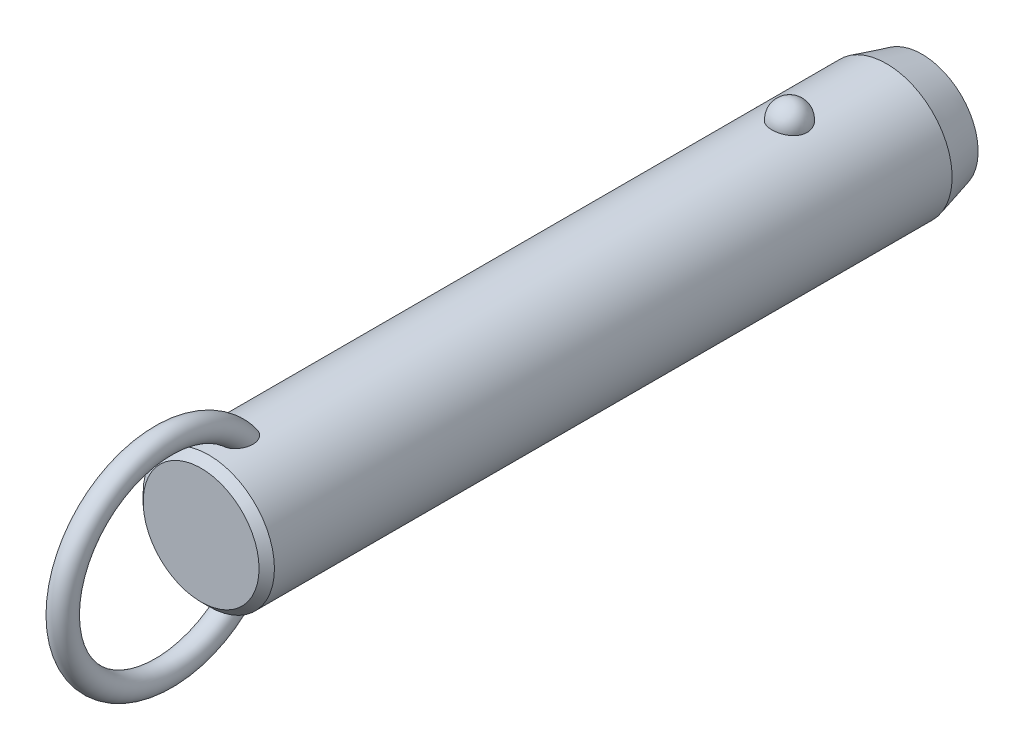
ISO-10303-21;
HEADER;
FILE_DESCRIPTION(('STEP AP214'),'2;1');
FILE_NAME('part.step','',(''),(''),'','','');
FILE_SCHEMA(('AUTOMOTIVE_DESIGN { 1 0 10303 214 1 1 1 1 }'));
ENDSEC;
DATA;
#1=APPLICATION_CONTEXT('core data for automotive mechanical design processes');
#2=APPLICATION_PROTOCOL_DEFINITION('international standard','automotive_design',2000,#1);
#3=PRODUCT_CONTEXT('',#1,'mechanical');
#4=PRODUCT('Part','Part','',(#3));
#5=PRODUCT_RELATED_PRODUCT_CATEGORY('part','',(#4));
#6=PRODUCT_DEFINITION_FORMATION('','',#4);
#7=PRODUCT_DEFINITION_CONTEXT('part definition',#1,'design');
#8=PRODUCT_DEFINITION('design','',#6,#7);
#9=PRODUCT_DEFINITION_SHAPE('','',#8);
#10=(LENGTH_UNIT() NAMED_UNIT(*) SI_UNIT(.MILLI.,.METRE.));
#11=(NAMED_UNIT(*) PLANE_ANGLE_UNIT() SI_UNIT($,.RADIAN.));
#12=(NAMED_UNIT(*) SI_UNIT($,.STERADIAN.) SOLID_ANGLE_UNIT());
#13=UNCERTAINTY_MEASURE_WITH_UNIT(LENGTH_MEASURE(1.E-05),#10,'distance_accuracy_value','');
#14=(GEOMETRIC_REPRESENTATION_CONTEXT(3) GLOBAL_UNCERTAINTY_ASSIGNED_CONTEXT((#13)) GLOBAL_UNIT_ASSIGNED_CONTEXT((#10,
#11,#12)) REPRESENTATION_CONTEXT('',''));
#15=CARTESIAN_POINT('',(0.,0.,0.));
#16=DIRECTION('',(0.,0.,1.));
#17=DIRECTION('',(1.,0.,0.));
#18=AXIS2_PLACEMENT_3D('',#15,#16,#17);
#19=CARTESIAN_POINT('',(0.,0.,83.8));
#20=DIRECTION('',(0.,0.,-1.));
#21=DIRECTION('',(-1.,0.,0.));
#22=AXIS2_PLACEMENT_3D('',#19,#20,#21);
#23=CYLINDRICAL_SURFACE('',#22,11.1);
#24=CARTESIAN_POINT('',(2.9724815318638,10.6945945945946,-3.));
#25=CARTESIAN_POINT('',(2.97247830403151,10.6945972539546,-2.83225059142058));
#26=CARTESIAN_POINT('',(2.95876598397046,10.6984356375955,-2.66445972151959));
#27=CARTESIAN_POINT('',(2.90424529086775,10.7133624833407,-2.33362381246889));
#28=CARTESIAN_POINT('',(2.8634252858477,10.7244540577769,-2.1705808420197));
#29=CARTESIAN_POINT('',(2.75573657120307,10.7526272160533,-1.85396767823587));
#30=CARTESIAN_POINT('',(2.68887937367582,10.7697061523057,-1.70039333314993));
#31=CARTESIAN_POINT('',(2.53079696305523,10.8079438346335,-1.40691598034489));
#32=CARTESIAN_POINT('',(2.43957264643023,10.8291024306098,-1.2670124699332));
#33=CARTESIAN_POINT('',(2.23458150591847,10.8732541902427,-1.00409565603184));
#34=CARTESIAN_POINT('',(2.12071295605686,10.8962553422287,-0.881162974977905));
#35=CARTESIAN_POINT('',(1.87365402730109,10.9414421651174,-0.656352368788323));
#36=CARTESIAN_POINT('',(1.74046358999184,10.9636278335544,-0.554474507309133));
#37=CARTESIAN_POINT('',(1.45872188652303,11.0046495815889,-0.374872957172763));
#38=CARTESIAN_POINT('',(1.31021276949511,11.0234944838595,-0.297085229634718));
#39=CARTESIAN_POINT('',(1.00170030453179,11.0557957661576,-0.167529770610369));
#40=CARTESIAN_POINT('',(0.841698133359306,11.0692526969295,-0.115759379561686));
#41=CARTESIAN_POINT('',(0.517607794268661,11.0890932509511,-0.0403925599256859));
#42=CARTESIAN_POINT('',(0.353633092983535,11.0955916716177,-0.0163383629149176));
#43=CARTESIAN_POINT('',(0.0238420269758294,11.1011989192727,0.0044517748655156));
#44=CARTESIAN_POINT('',(-0.141974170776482,11.1003084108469,0.00119017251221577));
#45=CARTESIAN_POINT('',(-0.468405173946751,11.0912990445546,-0.0323233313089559));
#46=CARTESIAN_POINT('',(-0.629059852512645,11.0832767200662,-0.0622147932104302));
#47=CARTESIAN_POINT('',(-0.942937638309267,11.0609962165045,-0.147645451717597));
#48=CARTESIAN_POINT('',(-1.09616062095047,11.0467379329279,-0.203185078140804));
#49=CARTESIAN_POINT('',(-1.39181061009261,11.0134071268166,-0.3387529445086));
#50=CARTESIAN_POINT('',(-1.53417383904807,10.9943086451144,-0.418913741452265));
#51=CARTESIAN_POINT('',(-1.80342160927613,10.9533667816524,-0.60144882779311));
#52=CARTESIAN_POINT('',(-1.9303046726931,10.9315231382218,-0.703825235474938));
#53=CARTESIAN_POINT('',(-2.16747598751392,10.887005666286,-0.930091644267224));
#54=CARTESIAN_POINT('',(-2.27742774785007,10.8643239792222,-1.05433291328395));
#55=CARTESIAN_POINT('',(-2.47517316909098,10.8209886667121,-1.31966633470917));
#56=CARTESIAN_POINT('',(-2.56296538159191,10.8003351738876,-1.46075958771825));
#57=CARTESIAN_POINT('',(-2.71500300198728,10.7631304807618,-1.75753646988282));
#58=CARTESIAN_POINT('',(-2.77898901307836,10.7466250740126,-1.91335887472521));
#59=CARTESIAN_POINT('',(-2.88046189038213,10.7198747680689,-2.2339152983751));
#60=CARTESIAN_POINT('',(-2.91794947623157,10.709629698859,-2.39864907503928));
#61=CARTESIAN_POINT('',(-2.96537819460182,10.6965949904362,-2.73165170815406));
#62=CARTESIAN_POINT('',(-2.97542891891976,10.693775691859,-2.89990378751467));
#63=CARTESIAN_POINT('',(-2.96804271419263,10.6958279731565,-3.235752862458));
#64=CARTESIAN_POINT('',(-2.95060646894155,10.7006993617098,-3.40334987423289));
#65=CARTESIAN_POINT('',(-2.88883358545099,10.71753912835,-3.73233906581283));
#66=CARTESIAN_POINT('',(-2.84462026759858,10.7294749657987,-3.89375610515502));
#67=CARTESIAN_POINT('',(-2.73050447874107,10.7590797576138,-4.20667949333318));
#68=CARTESIAN_POINT('',(-2.66060103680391,10.7767489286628,-4.35818546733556));
#69=CARTESIAN_POINT('',(-2.49642559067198,10.8159599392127,-4.6478542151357));
#70=CARTESIAN_POINT('',(-2.40203047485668,10.8375211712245,-4.78594458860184));
#71=CARTESIAN_POINT('',(-2.19143488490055,10.8820570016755,-5.0441038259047));
#72=CARTESIAN_POINT('',(-2.07523364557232,10.9050316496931,-5.16417205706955));
#73=CARTESIAN_POINT('',(-1.82361254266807,10.9499219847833,-5.38334833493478));
#74=CARTESIAN_POINT('',(-1.68812945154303,10.9718338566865,-5.48238464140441));
#75=CARTESIAN_POINT('',(-1.40191298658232,11.0120611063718,-5.65618873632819));
#76=CARTESIAN_POINT('',(-1.25118062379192,11.0303767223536,-5.73095813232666));
#77=CARTESIAN_POINT('',(-0.940570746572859,11.0611653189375,-5.85334725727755));
#78=CARTESIAN_POINT('',(-0.780821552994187,11.0737044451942,-5.90127578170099));
#79=CARTESIAN_POINT('',(-0.455204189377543,11.0918598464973,-5.96992976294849));
#80=CARTESIAN_POINT('',(-0.289336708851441,11.0974768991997,-5.99065827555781));
#81=CARTESIAN_POINT('',(0.0406846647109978,11.1011307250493,-6.00418773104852));
#82=CARTESIAN_POINT('',(0.204817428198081,11.099299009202,-5.99747318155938));
#83=CARTESIAN_POINT('',(0.5295530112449,11.088551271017,-5.9574031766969));
#84=CARTESIAN_POINT('',(0.69015594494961,11.0796354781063,-5.92404858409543));
#85=CARTESIAN_POINT('',(1.0027760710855,11.0557204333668,-5.83180084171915));
#86=CARTESIAN_POINT('',(1.15482001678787,11.0407414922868,-5.77299291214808));
#87=CARTESIAN_POINT('',(1.44678373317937,11.0062913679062,-5.63147366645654));
#88=CARTESIAN_POINT('',(1.58670279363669,10.9868199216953,-5.54876095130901));
#89=CARTESIAN_POINT('',(1.8527023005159,10.9451315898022,-5.36027644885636));
#90=CARTESIAN_POINT('',(1.97855158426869,10.9228788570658,-5.25418644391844));
#91=CARTESIAN_POINT('',(2.21080872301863,10.8782509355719,-5.02251354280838));
#92=CARTESIAN_POINT('',(2.31721312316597,10.8558757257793,-4.89692718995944));
#93=CARTESIAN_POINT('',(2.5094551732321,10.8130715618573,-4.62745408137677));
#94=CARTESIAN_POINT('',(2.59493284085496,10.7926798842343,-4.48330448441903));
#95=CARTESIAN_POINT('',(2.740862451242,10.7565495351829,-4.18236358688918));
#96=CARTESIAN_POINT('',(2.80132490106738,10.7408089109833,-4.02557762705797));
#97=CARTESIAN_POINT('',(2.88959070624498,10.7173718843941,-3.72475308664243));
#98=CARTESIAN_POINT('',(2.92062102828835,10.7088950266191,-3.58171216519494));
#99=CARTESIAN_POINT('',(2.96206765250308,10.6975052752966,-3.29245795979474));
#100=CARTESIAN_POINT('',(2.97248434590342,10.6945922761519,-3.14624473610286));
#101=CARTESIAN_POINT('',(2.9724815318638,10.6945945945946,-3.));
#102=B_SPLINE_CURVE_WITH_KNOTS('',3,(#24,#25,#26,#27,#28,#29,#30,#31,#32,#33,#34,#35,#36,#37,
#38,#39,#40,#41,#42,#43,#44,#45,#46,#47,#48,#49,#50,#51,#52,#53,#54,#55,#56,#57,#58,#59,#60,#61,
#62,#63,#64,#65,#66,#67,#68,#69,#70,#71,#72,#73,#74,#75,#76,#77,#78,#79,#80,#81,#82,#83,#84,#85,
#86,#87,#88,#89,#90,#91,#92,#93,#94,#95,#96,#97,#98,#99,#100,#101),.UNSPECIFIED.,.T.,.F.,(4,2,2,
2,2,2,2,2,2,2,2,2,2,2,2,2,2,2,2,2,2,2,2,2,2,2,2,2,2,2,2,2,2,2,2,2,2,2,4),(0.,0.502722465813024,
1.00566079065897,1.5083769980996,2.01107471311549,2.51608392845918,3.02109467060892,
3.52475118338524,4.02835620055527,4.523518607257,5.0186364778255,5.50715297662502,
5.9956776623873,6.48688002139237,6.97812923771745,7.47814366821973,7.9781907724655,
8.48353712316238,8.9888697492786,9.49218093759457,9.99547960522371,10.4964777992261,
10.997494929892,11.5010810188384,12.0046847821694,12.5099796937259,13.0152411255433,
13.5145635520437,14.0138298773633,14.5043200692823,14.9947943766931,15.4836390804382,
15.9725123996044,16.4685040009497,16.9645836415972,17.4686765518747,17.972557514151,
18.410841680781,18.849117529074),.UNSPECIFIED.);
#103=CARTESIAN_POINT('',(2.9724815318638,10.6945945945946,-3.));
#104=VERTEX_POINT('',#103);
#105=EDGE_CURVE('E41',#104,#104,#102,.T.);
#106=ORIENTED_EDGE('',*,*,#105,.T.);
#107=EDGE_LOOP('',(#106));
#108=FACE_BOUND('',#107,.T.);
#109=CARTESIAN_POINT('',(0.,0.,95.2));
#110=DIRECTION('',(0.,0.,1.));
#111=DIRECTION('',(1.,0.,0.));
#112=AXIS2_PLACEMENT_3D('',#109,#110,#111);
#113=CIRCLE('',#112,11.1);
#114=CARTESIAN_POINT('',(11.1,0.,95.2));
#115=VERTEX_POINT('',#114);
#116=EDGE_CURVE('E10',#115,#115,#113,.F.);
#117=ORIENTED_EDGE('',*,*,#116,.T.);
#118=EDGE_LOOP('',(#117));
#119=FACE_BOUND('',#118,.T.);
#120=CARTESIAN_POINT('',(-0.564520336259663,-11.0856356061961,87.4578154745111));
#121=CARTESIAN_POINT('',(-0.667202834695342,-11.0804062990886,87.4912839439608));
#122=CARTESIAN_POINT('',(-0.766875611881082,-11.0738877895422,87.5338357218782));
#123=CARTESIAN_POINT('',(-0.957284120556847,-11.0590576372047,87.6354190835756));
#124=CARTESIAN_POINT('',(-1.04801616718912,-11.0507452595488,87.6944574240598));
#125=CARTESIAN_POINT('',(-1.21800952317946,-11.0333016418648,87.8265293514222));
#126=CARTESIAN_POINT('',(-1.29730805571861,-11.0241732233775,87.8995156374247));
#127=CARTESIAN_POINT('',(-1.44337665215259,-11.0060026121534,88.0570374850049));
#128=CARTESIAN_POINT('',(-1.51014622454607,-10.9969604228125,88.1415734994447));
#129=CARTESIAN_POINT('',(-1.63454620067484,-10.9791841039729,88.3255213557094));
#130=CARTESIAN_POINT('',(-1.69127003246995,-10.9705107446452,88.4255493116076));
#131=CARTESIAN_POINT('',(-1.78980785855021,-10.9548648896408,88.6327902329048));
#132=CARTESIAN_POINT('',(-1.83161214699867,-10.9478935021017,88.7400078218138));
#133=CARTESIAN_POINT('',(-1.91557028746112,-10.9335803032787,89.0054080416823));
#134=CARTESIAN_POINT('',(-1.95040620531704,-10.9273269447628,89.1659806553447));
#135=CARTESIAN_POINT('',(-1.99388326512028,-10.9194709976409,89.4906977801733));
#136=CARTESIAN_POINT('',(-2.00248051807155,-10.9178762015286,89.6548478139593));
#137=CARTESIAN_POINT('',(-1.99551615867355,-10.9191578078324,90.0246504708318));
#138=CARTESIAN_POINT('',(-1.9732206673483,-10.9232807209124,90.2301911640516));
#139=CARTESIAN_POINT('',(-1.91529761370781,-10.9335244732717,90.5335954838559));
#140=CARTESIAN_POINT('',(-1.8918457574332,-10.9376266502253,90.6340883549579));
#141=CARTESIAN_POINT('',(-1.83700674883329,-10.9469720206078,90.832855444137));
#142=CARTESIAN_POINT('',(-1.80562070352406,-10.9522150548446,90.9311299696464));
#143=CARTESIAN_POINT('',(-1.73463055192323,-10.9636837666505,91.1259148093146));
#144=CARTESIAN_POINT('',(-1.69493416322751,-10.9699202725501,91.2223907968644));
#145=CARTESIAN_POINT('',(-1.6074514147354,-10.9830806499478,91.4116262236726));
#146=CARTESIAN_POINT('',(-1.55966150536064,-10.9900048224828,91.5043840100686));
#147=CARTESIAN_POINT('',(-1.45591812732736,-11.0042280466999,91.6846907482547));
#148=CARTESIAN_POINT('',(-1.40000013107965,-11.0115253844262,91.7722601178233));
#149=CARTESIAN_POINT('',(-1.27937470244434,-11.0261911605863,91.9410298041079));
#150=CARTESIAN_POINT('',(-1.21467835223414,-11.0335594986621,92.0222379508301));
#151=CARTESIAN_POINT('',(-1.08218150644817,-11.0473027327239,92.1690010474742));
#152=CARTESIAN_POINT('',(-1.01522633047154,-11.0537063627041,92.235309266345));
#153=CARTESIAN_POINT('',(-0.872952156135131,-11.065850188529,92.3583780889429));
#154=CARTESIAN_POINT('',(-0.797642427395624,-11.0715911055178,92.4151491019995));
#155=CARTESIAN_POINT('',(-0.651396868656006,-11.081071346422,92.5075155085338));
#156=CARTESIAN_POINT('',(-0.581712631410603,-11.0849841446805,92.5450491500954));
#157=CARTESIAN_POINT('',(-0.437066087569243,-11.0916271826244,92.6082594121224));
#158=CARTESIAN_POINT('',(-0.362109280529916,-11.0943586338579,92.6339481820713));
#159=CARTESIAN_POINT('',(-0.207828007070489,-11.0983242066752,92.671117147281));
#160=CARTESIAN_POINT('',(-0.128467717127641,-11.0995432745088,92.6824545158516));
#161=CARTESIAN_POINT('',(0.0309101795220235,-11.1002423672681,92.6889658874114));
#162=CARTESIAN_POINT('',(0.110927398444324,-11.0997233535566,92.6841488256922));
#163=CARTESIAN_POINT('',(0.256406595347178,-11.097240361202,92.6609599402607));
#164=CARTESIAN_POINT('',(0.32223577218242,-11.0955074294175,92.6447543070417));
#165=CARTESIAN_POINT('',(0.450635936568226,-11.0910350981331,92.6026008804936));
#166=CARTESIAN_POINT('',(0.513205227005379,-11.0882951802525,92.5766480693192));
#167=CARTESIAN_POINT('',(0.662626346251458,-11.0805620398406,92.5026073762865));
#168=CARTESIAN_POINT('',(0.747127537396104,-11.0751144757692,92.4498452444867));
#169=CARTESIAN_POINT('',(0.906756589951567,-11.0631932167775,92.3317206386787));
#170=CARTESIAN_POINT('',(0.981859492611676,-11.0567168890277,92.2663257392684));
#171=CARTESIAN_POINT('',(1.10712207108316,-11.0447856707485,92.1422633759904));
#172=CARTESIAN_POINT('',(1.15909566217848,-11.0394280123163,92.0853831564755));
#173=CARTESIAN_POINT('',(1.25791923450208,-11.0286040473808,91.9673271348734));
#174=CARTESIAN_POINT('',(1.30476642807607,-11.0231376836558,91.9061490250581));
#175=CARTESIAN_POINT('',(1.43818612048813,-11.0068027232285,91.717305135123));
#176=CARTESIAN_POINT('',(1.51751767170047,-10.9960104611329,91.5844531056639));
#177=CARTESIAN_POINT('',(1.63597546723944,-10.9788847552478,91.3531371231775));
#178=CARTESIAN_POINT('',(1.67988876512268,-10.9722190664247,91.2570530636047));
#179=CARTESIAN_POINT('',(1.75953241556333,-10.9597298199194,91.0614311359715));
#180=CARTESIAN_POINT('',(1.79525967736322,-10.9539065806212,90.9618919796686));
#181=CARTESIAN_POINT('',(1.85844731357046,-10.9433632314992,90.7602111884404));
#182=CARTESIAN_POINT('',(1.88591073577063,-10.9386427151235,90.6580705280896));
#183=CARTESIAN_POINT('',(1.93234324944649,-10.9305350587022,90.4518191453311));
#184=CARTESIAN_POINT('',(1.95131065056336,-10.9271481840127,90.3477080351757));
#185=CARTESIAN_POINT('',(1.99040203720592,-10.9201183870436,90.0654588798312));
#186=CARTESIAN_POINT('',(2.00221217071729,-10.9179256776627,89.8860370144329));
#187=CARTESIAN_POINT('',(1.99711676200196,-10.9188636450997,89.5277133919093));
#188=CARTESIAN_POINT('',(1.98026150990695,-10.9219849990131,89.348811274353));
#189=CARTESIAN_POINT('',(1.92151657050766,-10.9324473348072,89.0364514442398));
#190=CARTESIAN_POINT('',(1.88605081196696,-10.9386915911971,88.9017594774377));
#191=CARTESIAN_POINT('',(1.7939302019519,-10.9541780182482,88.6399669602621));
#192=CARTESIAN_POINT('',(1.73729868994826,-10.9634168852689,88.5128582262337));
#193=CARTESIAN_POINT('',(1.612370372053,-10.9824218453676,88.2894184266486));
#194=CARTESIAN_POINT('',(1.54715374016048,-10.9918945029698,88.1913455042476));
#195=CARTESIAN_POINT('',(1.40127026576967,-11.0114415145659,88.0074341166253));
#196=CARTESIAN_POINT('',(1.32060742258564,-11.0215157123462,87.9215924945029));
#197=CARTESIAN_POINT('',(1.14474787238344,-11.041168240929,87.7651630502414));
#198=CARTESIAN_POINT('',(1.04947805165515,-11.0507437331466,87.6946565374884));
#199=CARTESIAN_POINT('',(0.847278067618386,-11.0680789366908,87.572640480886));
#200=CARTESIAN_POINT('',(0.74035174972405,-11.0758392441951,87.5211246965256));
#201=CARTESIAN_POINT('',(0.52928931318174,-11.0878275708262,87.4434852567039));
#202=CARTESIAN_POINT('',(0.425895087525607,-11.0923259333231,87.415377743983));
#203=CARTESIAN_POINT('',(0.215723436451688,-11.0984001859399,87.3777038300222));
#204=CARTESIAN_POINT('',(0.108947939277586,-11.0999777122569,87.3681270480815));
#205=CARTESIAN_POINT('',(-0.0938962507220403,-11.1000196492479,87.3678773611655));
#206=CARTESIAN_POINT('',(-0.189967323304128,-11.0987797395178,87.3754089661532));
#207=CARTESIAN_POINT('',(-0.379657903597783,-11.0939111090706,87.4055079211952));
#208=CARTESIAN_POINT('',(-0.473277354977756,-11.0902823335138,87.4280756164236));
#209=CARTESIAN_POINT('',(-0.564520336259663,-11.0856356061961,87.4578154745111));
#210=B_SPLINE_CURVE_WITH_KNOTS('',3,(#120,#121,#122,#123,#124,#125,#126,#127,#128,#129,#130,
#131,#132,#133,#134,#135,#136,#137,#138,#139,#140,#141,#142,#143,#144,#145,#146,#147,#148,#149,
#150,#151,#152,#153,#154,#155,#156,#157,#158,#159,#160,#161,#162,#163,#164,#165,#166,#167,#168,
#169,#170,#171,#172,#173,#174,#175,#176,#177,#178,#179,#180,#181,#182,#183,#184,#185,#186,#187,
#188,#189,#190,#191,#192,#193,#194,#195,#196,#197,#198,#199,#200,#201,#202,#203,#204,#205,#206,
#207,#208,#209),.UNSPECIFIED.,.T.,.F.,(4,2,2,2,2,2,2,2,2,2,2,2,2,2,2,2,2,2,2,2,2,2,2,2,2,2,2,2,
2,2,2,2,2,2,2,2,2,2,2,2,2,2,2,2,4),(0.,0.323999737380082,0.648132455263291,0.971184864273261,
1.29424994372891,1.63886237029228,1.98369857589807,2.47426059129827,2.96564271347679,
3.58257396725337,3.89215258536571,4.20168803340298,4.51486273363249,4.82817514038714,
5.14015911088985,5.45175282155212,5.73442856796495,6.01679375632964,6.25364580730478,
6.49025437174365,6.7291996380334,6.96801276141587,7.17061258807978,7.37331685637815,
7.67094989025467,7.96935728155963,8.20075067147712,8.43226927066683,8.89581623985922,
9.2130653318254,9.53043400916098,9.84768549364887,10.1650000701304,10.70229304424,
11.2386443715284,11.6553390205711,12.0715755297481,12.4245637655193,12.7774607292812,
13.1321855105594,13.4867936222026,13.8068771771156,14.1267813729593,14.4146787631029,
14.7025827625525),.UNSPECIFIED.);
#211=CARTESIAN_POINT('',(-0.564520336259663,-11.0856356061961,87.4578154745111));
#212=VERTEX_POINT('',#211);
#213=EDGE_CURVE('E60',#212,#212,#210,.T.);
#214=ORIENTED_EDGE('',*,*,#213,.T.);
#215=EDGE_LOOP('',(#214));
#216=FACE_BOUND('',#215,.T.);
#217=CARTESIAN_POINT('',(-0.564520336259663,11.0856356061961,87.4578154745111));
#218=CARTESIAN_POINT('',(-0.468542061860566,11.0905203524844,87.4265456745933));
#219=CARTESIAN_POINT('',(-0.36979381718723,11.0942886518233,87.4031576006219));
#220=CARTESIAN_POINT('',(-0.169555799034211,11.0991586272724,87.3730858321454));
#221=CARTESIAN_POINT('',(-0.0680604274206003,11.1002543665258,87.3664393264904));
#222=CARTESIAN_POINT('',(0.134549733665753,11.099646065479,87.3701579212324));
#223=CARTESIAN_POINT('',(0.235664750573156,11.0979441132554,87.3805103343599));
#224=CARTESIAN_POINT('',(0.43463240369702,11.0919342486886,87.4178318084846));
#225=CARTESIAN_POINT('',(0.53248665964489,11.0876276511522,87.4447924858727));
#226=CARTESIAN_POINT('',(0.72244585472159,11.0768742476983,87.5144096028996));
#227=CARTESIAN_POINT('',(0.814543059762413,11.0704246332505,87.5570866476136));
#228=CARTESIAN_POINT('',(0.990565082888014,11.0560659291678,87.6566487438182));
#229=CARTESIAN_POINT('',(1.07448844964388,11.048156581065,87.7135363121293));
#230=CARTESIAN_POINT('',(1.23562672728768,11.0313221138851,87.8422106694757));
#231=CARTESIAN_POINT('',(1.31242684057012,11.0223686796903,87.9145117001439));
#232=CARTESIAN_POINT('',(1.45398030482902,11.0045918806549,88.0700425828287));
#233=CARTESIAN_POINT('',(1.51873073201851,10.9957685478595,88.1532750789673));
#234=CARTESIAN_POINT('',(1.64107232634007,10.9782087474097,88.3363842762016));
#235=CARTESIAN_POINT('',(1.69743176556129,10.9695572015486,88.4370893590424));
#236=CARTESIAN_POINT('',(1.79515063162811,10.9539887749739,88.6456264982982));
#237=CARTESIAN_POINT('',(1.83649966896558,10.9470730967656,88.7534634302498));
#238=CARTESIAN_POINT('',(1.91931148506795,10.9329211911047,89.0203995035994));
#239=CARTESIAN_POINT('',(1.9534010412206,10.9267904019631,89.1818612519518));
#240=CARTESIAN_POINT('',(1.99526195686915,10.9192174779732,89.5082163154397));
#241=CARTESIAN_POINT('',(2.00298989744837,10.9177830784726,89.6731148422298));
#242=CARTESIAN_POINT('',(1.99396251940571,10.9194420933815,90.0441006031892));
#243=CARTESIAN_POINT('',(1.97050829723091,10.923774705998,90.2500387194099));
#244=CARTESIAN_POINT('',(1.91079643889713,10.9343131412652,90.5539019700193));
#245=CARTESIAN_POINT('',(1.88673702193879,10.9385106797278,90.6545296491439));
#246=CARTESIAN_POINT('',(1.83065508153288,10.9480376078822,90.8535107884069));
#247=CARTESIAN_POINT('',(1.79863369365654,10.9533668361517,90.951864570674));
#248=CARTESIAN_POINT('',(1.72633365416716,10.9649954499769,91.146720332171));
#249=CARTESIAN_POINT('',(1.68596409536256,10.9713053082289,91.2431879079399));
#250=CARTESIAN_POINT('',(1.59707998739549,10.9845964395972,91.432323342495));
#251=CARTESIAN_POINT('',(1.54856169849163,10.9915780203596,91.5249894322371));
#252=CARTESIAN_POINT('',(1.44330168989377,11.0058935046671,91.7049752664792));
#253=CARTESIAN_POINT('',(1.38659749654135,11.0132257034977,91.792316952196));
#254=CARTESIAN_POINT('',(1.26431158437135,11.0279330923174,91.9604563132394));
#255=CARTESIAN_POINT('',(1.19874160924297,11.0353082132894,92.0412624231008));
#256=CARTESIAN_POINT('',(1.06542088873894,11.0489310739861,92.1859856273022));
#257=CARTESIAN_POINT('',(0.998640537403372,11.0552153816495,92.250784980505));
#258=CARTESIAN_POINT('',(0.856896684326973,11.0671032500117,92.370846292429));
#259=CARTESIAN_POINT('',(0.781942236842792,11.0727075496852,92.4261186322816));
#260=CARTESIAN_POINT('',(0.636276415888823,11.081949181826,92.5159721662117));
#261=CARTESIAN_POINT('',(0.5667558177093,11.0857572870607,92.5524410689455));
#262=CARTESIAN_POINT('',(0.422602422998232,11.0921860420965,92.6135333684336));
#263=CARTESIAN_POINT('',(0.347974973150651,11.0948079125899,92.6381689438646));
#264=CARTESIAN_POINT('',(0.194593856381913,11.0985608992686,92.6733233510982));
#265=CARTESIAN_POINT('',(0.115807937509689,11.0996777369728,92.6837069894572));
#266=CARTESIAN_POINT('',(-0.0422499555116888,11.1002003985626,92.6885747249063));
#267=CARTESIAN_POINT('',(-0.121521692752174,11.09960699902,92.683066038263));
#268=CARTESIAN_POINT('',(-0.266046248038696,11.0970123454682,92.6588271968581));
#269=CARTESIAN_POINT('',(-0.331661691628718,11.0952283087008,92.6421356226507));
#270=CARTESIAN_POINT('',(-0.459588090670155,11.0906663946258,92.5991117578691));
#271=CARTESIAN_POINT('',(-0.521897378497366,11.0878880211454,92.572774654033));
#272=CARTESIAN_POINT('',(-0.671446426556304,11.0800342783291,92.4975130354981));
#273=CARTESIAN_POINT('',(-0.756250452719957,11.0744969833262,92.4438182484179));
#274=CARTESIAN_POINT('',(-0.916349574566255,11.0624045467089,92.3238029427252));
#275=CARTESIAN_POINT('',(-0.991618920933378,11.0558467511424,92.2574493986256));
#276=CARTESIAN_POINT('',(-1.11713140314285,11.0437783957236,92.1316335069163));
#277=CARTESIAN_POINT('',(-1.16920539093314,11.0383619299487,92.0739524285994));
#278=CARTESIAN_POINT('',(-1.26817476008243,11.02743010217,91.9542809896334));
#279=CARTESIAN_POINT('',(-1.31506731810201,11.0219146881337,91.8922883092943));
#280=CARTESIAN_POINT('',(-1.40399813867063,11.0109399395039,91.7647843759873));
#281=CARTESIAN_POINT('',(-1.4460286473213,11.0054807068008,91.6992677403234));
#282=CARTESIAN_POINT('',(-1.52538779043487,10.9947621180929,91.5654223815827));
#283=CARTESIAN_POINT('',(-1.56271516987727,10.9895028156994,91.4970929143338));
#284=CARTESIAN_POINT('',(-1.64537943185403,10.9774790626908,91.3332101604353));
#285=CARTESIAN_POINT('',(-1.68879497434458,10.9708503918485,91.2366735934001));
#286=CARTESIAN_POINT('',(-1.76740738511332,10.9584602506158,91.0402369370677));
#287=CARTESIAN_POINT('',(-1.80260120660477,10.95269910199,90.9403356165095));
#288=CARTESIAN_POINT('',(-1.86468657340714,10.9423003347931,90.7379663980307));
#289=CARTESIAN_POINT('',(-1.8915816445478,10.9376622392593,90.6354996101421));
#290=CARTESIAN_POINT('',(-1.93682458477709,10.9297405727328,90.4286429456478));
#291=CARTESIAN_POINT('',(-1.9551708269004,10.9264572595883,90.3242527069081));
#292=CARTESIAN_POINT('',(-1.99232562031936,10.9197647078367,90.0426287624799));
#293=CARTESIAN_POINT('',(-2.00294603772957,10.9177914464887,89.8641857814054));
#294=CARTESIAN_POINT('',(-1.99566675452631,10.9191290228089,89.5079962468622));
#295=CARTESIAN_POINT('',(-1.97781651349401,10.9224306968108,89.3302490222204));
#296=CARTESIAN_POINT('',(-1.91747214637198,10.9331592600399,89.0197921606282));
#297=CARTESIAN_POINT('',(-1.88131022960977,10.9395108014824,88.885825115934));
#298=CARTESIAN_POINT('',(-1.78790380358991,10.9551659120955,88.6255975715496));
#299=CARTESIAN_POINT('',(-1.7306830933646,10.9644661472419,88.4993285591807));
#300=CARTESIAN_POINT('',(-1.60475573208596,10.9835398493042,88.2774156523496));
#301=CARTESIAN_POINT('',(-1.53908879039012,10.9930297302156,88.1800265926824));
#302=CARTESIAN_POINT('',(-1.39238608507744,11.0125708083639,87.9975250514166));
#303=CARTESIAN_POINT('',(-1.31135150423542,11.0226219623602,87.9124116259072));
#304=CARTESIAN_POINT('',(-1.14382035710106,11.0411991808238,87.7652994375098));
#305=CARTESIAN_POINT('',(-1.05858500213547,11.0497792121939,87.7018693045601));
#306=CARTESIAN_POINT('',(-0.878723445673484,11.0655285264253,87.5902505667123));
#307=CARTESIAN_POINT('',(-0.784123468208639,11.0727015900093,87.5420208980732));
#308=CARTESIAN_POINT('',(-0.646163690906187,11.0812501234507,87.486023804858));
#309=CARTESIAN_POINT('',(-0.605595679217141,11.0835451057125,87.4711978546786));
#310=CARTESIAN_POINT('',(-0.564520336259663,11.0856356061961,87.4578154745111));
#311=B_SPLINE_CURVE_WITH_KNOTS('',3,(#217,#218,#219,#220,#221,#222,#223,#224,#225,#226,#227,
#228,#229,#230,#231,#232,#233,#234,#235,#236,#237,#238,#239,#240,#241,#242,#243,#244,#245,#246,
#247,#248,#249,#250,#251,#252,#253,#254,#255,#256,#257,#258,#259,#260,#261,#262,#263,#264,#265,
#266,#267,#268,#269,#270,#271,#272,#273,#274,#275,#276,#277,#278,#279,#280,#281,#282,#283,#284,
#285,#286,#287,#288,#289,#290,#291,#292,#293,#294,#295,#296,#297,#298,#299,#300,#301,#302,#303,
#304,#305,#306,#307,#308,#309,#310),.UNSPECIFIED.,.T.,.F.,(4,2,2,2,2,2,2,2,2,2,2,2,2,2,2,2,2,2,
2,2,2,2,2,2,2,2,2,2,2,2,2,2,2,2,2,2,2,2,2,2,2,2,2,2,2,2,4),(0.,0.303061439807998,
0.606795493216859,0.910302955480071,1.21365733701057,1.51741085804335,1.82121821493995,
2.1374520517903,2.45376252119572,2.79958678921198,3.14564996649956,3.63832391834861,
4.13180893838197,4.75031912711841,5.06071926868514,5.37107516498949,5.68500772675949,
5.99908475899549,6.31176519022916,6.62403542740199,6.90315673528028,7.1819719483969,
7.41687778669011,7.65154134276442,7.88841587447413,8.12518286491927,8.3275284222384,
8.52997509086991,8.82986421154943,9.13054668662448,9.36393502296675,9.59744991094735,
9.83133221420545,10.0652767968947,10.383032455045,10.7009056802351,11.0186436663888,
11.3364420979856,11.8705925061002,12.4038159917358,12.8189662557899,13.2336487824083,
13.5857049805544,13.9377340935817,14.2561354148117,14.5736690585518,14.7033687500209),.UNSPECIFIED.);
#312=CARTESIAN_POINT('',(-0.564520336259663,11.0856356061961,87.4578154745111));
#313=VERTEX_POINT('',#312);
#314=EDGE_CURVE('E68',#313,#313,#311,.T.);
#315=ORIENTED_EDGE('',*,*,#314,.T.);
#316=EDGE_LOOP('',(#315));
#317=FACE_BOUND('',#316,.T.);
#318=CARTESIAN_POINT('',(0.,0.,-19.3999999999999));
#319=DIRECTION('',(0.,0.,-1.));
#320=DIRECTION('',(-1.,0.,0.));
#321=AXIS2_PLACEMENT_3D('',#318,#319,#320);
#322=CIRCLE('',#321,11.1);
#323=CARTESIAN_POINT('',(-11.1,0.,-19.3999999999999));
#324=VERTEX_POINT('',#323);
#325=EDGE_CURVE('E57',#324,#324,#322,.F.);
#326=ORIENTED_EDGE('',*,*,#325,.T.);
#327=EDGE_LOOP('',(#326));
#328=FACE_BOUND('',#327,.T.);
#329=ADVANCED_FACE('F37',(#108,#119,#216,#317,#328),#23,.T.);
#330=CARTESIAN_POINT('',(0.,0.,-25.4));
#331=DIRECTION('',(0.,0.,-1.));
#332=DIRECTION('',(-1.,0.,0.));
#333=AXIS2_PLACEMENT_3D('',#330,#331,#332);
#334=PLANE('',#333);
#335=CARTESIAN_POINT('',(0.,0.,-25.4));
#336=DIRECTION('',(0.,0.,-1.));
#337=DIRECTION('',(-1.,0.,0.));
#338=AXIS2_PLACEMENT_3D('',#335,#336,#337);
#339=CIRCLE('',#338,9.49230484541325);
#340=CARTESIAN_POINT('',(-9.49230484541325,0.,-25.4));
#341=VERTEX_POINT('',#340);
#342=EDGE_CURVE('E67',#341,#341,#339,.T.);
#343=ORIENTED_EDGE('',*,*,#342,.T.);
#344=EDGE_LOOP('',(#343));
#345=FACE_BOUND('',#344,.T.);
#346=ADVANCED_FACE('F86',(#345),#334,.T.);
#347=CARTESIAN_POINT('',(0.,0.,-25.4));
#348=DIRECTION('',(0.,0.,1.));
#349=DIRECTION('',(1.,0.,0.));
#350=AXIS2_PLACEMENT_3D('',#347,#348,#349);
#351=CONICAL_SURFACE('',#350,9.49230484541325,0.261799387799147);
#352=ORIENTED_EDGE('',*,*,#325,.F.);
#353=EDGE_LOOP('',(#352));
#354=FACE_BOUND('',#353,.T.);
#355=ORIENTED_EDGE('',*,*,#342,.F.);
#356=EDGE_LOOP('',(#355));
#357=FACE_BOUND('',#356,.T.);
#358=ADVANCED_FACE('F84',(#354,#357),#351,.T.);
#359=CARTESIAN_POINT('',(0.,0.,96.5));
#360=DIRECTION('',(0.,0.,1.));
#361=DIRECTION('',(1.,0.,0.));
#362=AXIS2_PLACEMENT_3D('',#359,#360,#361);
#363=PLANE('',#362);
#364=CARTESIAN_POINT('',(0.,0.,96.5));
#365=DIRECTION('',(0.,0.,1.));
#366=DIRECTION('',(1.,0.,0.));
#367=AXIS2_PLACEMENT_3D('',#364,#365,#366);
#368=CIRCLE('',#367,9.79999999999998);
#369=CARTESIAN_POINT('',(9.79999999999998,0.,96.5));
#370=VERTEX_POINT('',#369);
#371=EDGE_CURVE('E50',#370,#370,#368,.T.);
#372=ORIENTED_EDGE('',*,*,#371,.T.);
#373=EDGE_LOOP('',(#372));
#374=FACE_BOUND('',#373,.T.);
#375=ADVANCED_FACE('F78',(#374),#363,.T.);
#376=CARTESIAN_POINT('',(0.,0.,102.85));
#377=DIRECTION('',(1.,0.,0.));
#378=DIRECTION('',(0.,0.,-1.));
#379=AXIS2_PLACEMENT_3D('',#376,#377,#378);
#380=TOROIDAL_SURFACE('',#379,17.05,2.);
#381=ORIENTED_EDGE('',*,*,#314,.F.);
#382=EDGE_LOOP('',(#381));
#383=FACE_BOUND('',#382,.T.);
#384=ORIENTED_EDGE('',*,*,#213,.F.);
#385=EDGE_LOOP('',(#384));
#386=FACE_BOUND('',#385,.T.);
#387=ADVANCED_FACE('F74',(#383,#386),#380,.T.);
#388=CARTESIAN_POINT('',(0.,0.,96.5));
#389=DIRECTION('',(0.,0.,-1.));
#390=DIRECTION('',(-1.,0.,0.));
#391=AXIS2_PLACEMENT_3D('',#388,#389,#390);
#392=CONICAL_SURFACE('',#391,9.79999999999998,0.785398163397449);
#393=ORIENTED_EDGE('',*,*,#116,.F.);
#394=EDGE_LOOP('',(#393));
#395=FACE_BOUND('',#394,.T.);
#396=ORIENTED_EDGE('',*,*,#371,.F.);
#397=EDGE_LOOP('',(#396));
#398=FACE_BOUND('',#397,.T.);
#399=ADVANCED_FACE('F39',(#395,#398),#392,.T.);
#400=CARTESIAN_POINT('',(0.,11.1,-3.));
#401=DIRECTION('',(0.,1.,0.));
#402=DIRECTION('',(0.,0.,-1.));
#403=AXIS2_PLACEMENT_3D('',#400,#401,#402);
#404=SPHERICAL_SURFACE('',#403,3.);
#405=ORIENTED_EDGE('',*,*,#105,.F.);
#406=EDGE_LOOP('',(#405));
#407=FACE_BOUND('',#406,.T.);
#408=ADVANCED_FACE('F80',(#407),#404,.T.);
#409=CLOSED_SHELL('',(#329,#346,#358,#375,#387,#399,#408));
#410=MANIFOLD_SOLID_BREP('B2',#409);
#411=ADVANCED_BREP_SHAPE_REPRESENTATION('',(#18,#410),#14);
#412=SHAPE_DEFINITION_REPRESENTATION(#9,#411);
ENDSEC;
END-ISO-10303-21;
